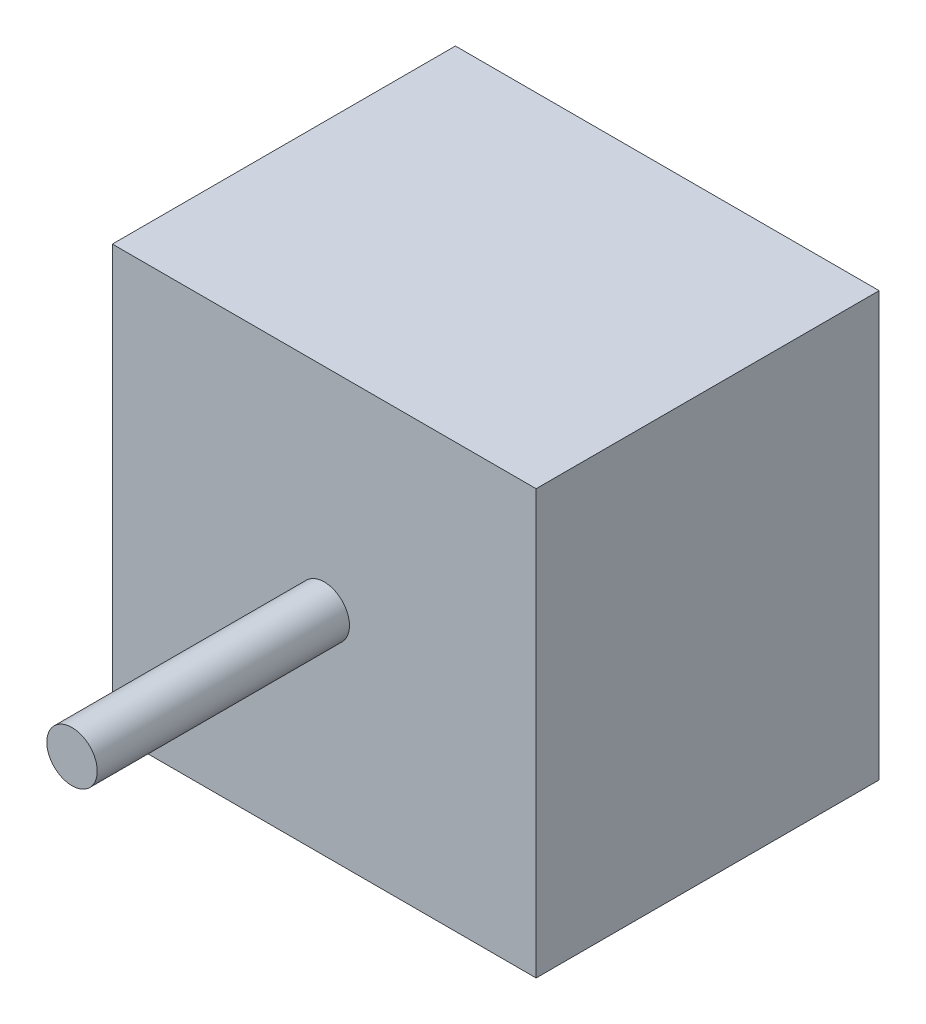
from build123d import *

# Parameters (mm, degrees)
SKETCH1_W           = 42
SKETCH1_H           = 42
BOSS_EXTRUDE1_DEPTH = 34
SKETCH2_R           = 2.5
BOSS_EXTRUDE2_DEPTH = 25


with BuildPart() as part:
    # Sketch1 → Boss-Extrude1 (new body)
    with BuildSketch(Plane.XY):
        Rectangle(SKETCH1_W, SKETCH1_H)
    extrude(amount=-BOSS_EXTRUDE1_DEPTH)

    # Sketch2 → Boss-Extrude2 (add)
    with BuildSketch(Plane.XY):
        Circle(SKETCH2_R)
    extrude(amount=BOSS_EXTRUDE2_DEPTH)


solid = part.part
